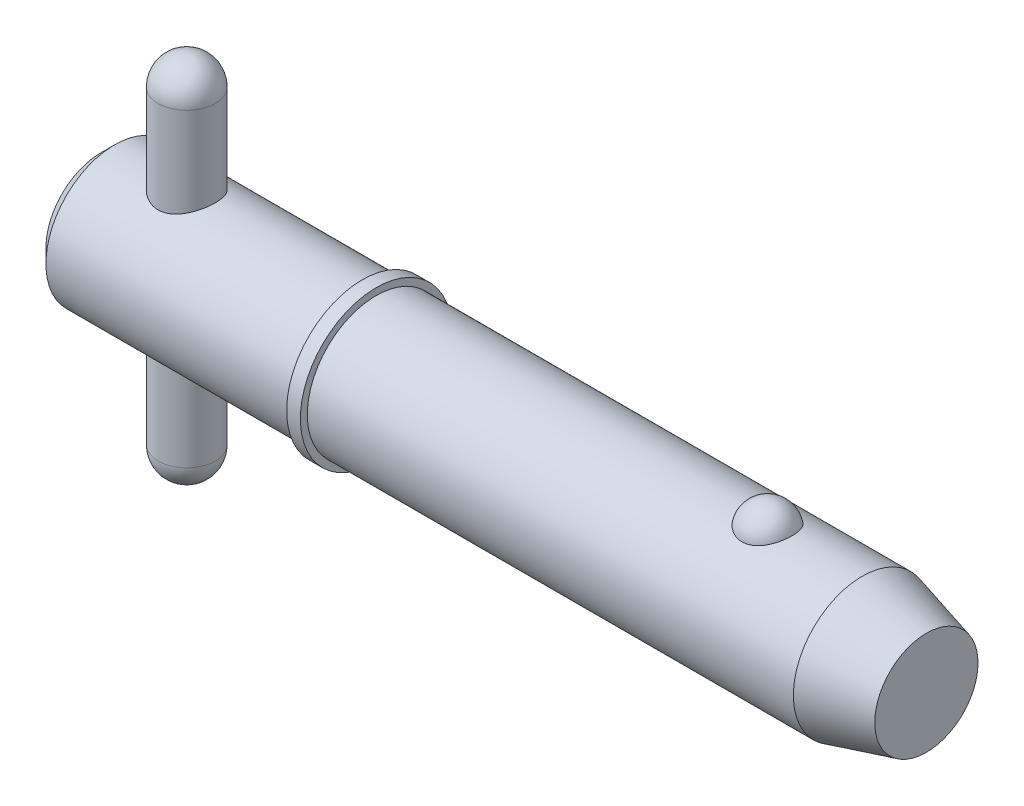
ISO-10303-21;
HEADER;
FILE_DESCRIPTION(('STEP AP214'),'2;1');
FILE_NAME('part.step','',(''),(''),'','','');
FILE_SCHEMA(('AUTOMOTIVE_DESIGN { 1 0 10303 214 1 1 1 1 }'));
ENDSEC;
DATA;
#1=APPLICATION_CONTEXT('core data for automotive mechanical design processes');
#2=APPLICATION_PROTOCOL_DEFINITION('international standard','automotive_design',2000,#1);
#3=PRODUCT_CONTEXT('',#1,'mechanical');
#4=PRODUCT('Part','Part','',(#3));
#5=PRODUCT_RELATED_PRODUCT_CATEGORY('part','',(#4));
#6=PRODUCT_DEFINITION_FORMATION('','',#4);
#7=PRODUCT_DEFINITION_CONTEXT('part definition',#1,'design');
#8=PRODUCT_DEFINITION('design','',#6,#7);
#9=PRODUCT_DEFINITION_SHAPE('','',#8);
#10=(LENGTH_UNIT() NAMED_UNIT(*) SI_UNIT(.MILLI.,.METRE.));
#11=(NAMED_UNIT(*) PLANE_ANGLE_UNIT() SI_UNIT($,.RADIAN.));
#12=(NAMED_UNIT(*) SI_UNIT($,.STERADIAN.) SOLID_ANGLE_UNIT());
#13=UNCERTAINTY_MEASURE_WITH_UNIT(LENGTH_MEASURE(1.E-05),#10,'distance_accuracy_value','');
#14=(GEOMETRIC_REPRESENTATION_CONTEXT(3) GLOBAL_UNCERTAINTY_ASSIGNED_CONTEXT((#13)) GLOBAL_UNIT_ASSIGNED_CONTEXT((#10,
#11,#12)) REPRESENTATION_CONTEXT('',''));
#15=CARTESIAN_POINT('',(0.,0.,0.));
#16=DIRECTION('',(0.,0.,1.));
#17=DIRECTION('',(1.,0.,0.));
#18=AXIS2_PLACEMENT_3D('',#15,#16,#17);
#19=CARTESIAN_POINT('',(5.94,12.7,0.));
#20=DIRECTION('',(0.,-1.,0.));
#21=DIRECTION('',(0.,0.,-1.));
#22=AXIS2_PLACEMENT_3D('',#19,#20,#21);
#23=CYLINDRICAL_SURFACE('',#22,1.98);
#24=CARTESIAN_POINT('',(5.94,-10.72,0.));
#25=DIRECTION('',(0.,-1.,0.));
#26=DIRECTION('',(0.,0.,-1.));
#27=AXIS2_PLACEMENT_3D('',#24,#25,#26);
#28=CIRCLE('',#27,1.98);
#29=CARTESIAN_POINT('',(5.94,-10.72,-1.98));
#30=VERTEX_POINT('',#29);
#31=EDGE_CURVE('P0_E10',#30,#30,#28,.F.);
#32=ORIENTED_EDGE('',*,*,#31,.T.);
#33=EDGE_LOOP('',(#32));
#34=FACE_BOUND('',#33,.T.);
#35=CARTESIAN_POINT('',(5.94,10.72,0.));
#36=DIRECTION('',(0.,-1.,0.));
#37=DIRECTION('',(0.,0.,-1.));
#38=AXIS2_PLACEMENT_3D('',#35,#36,#37);
#39=CIRCLE('',#38,1.98);
#40=CARTESIAN_POINT('',(5.94,10.72,-1.98));
#41=VERTEX_POINT('',#40);
#42=EDGE_CURVE('P0_E21',#41,#41,#39,.T.);
#43=ORIENTED_EDGE('',*,*,#42,.T.);
#44=EDGE_LOOP('',(#43));
#45=FACE_BOUND('',#44,.T.);
#46=ADVANCED_FACE('P0_F14',(#34,#45),#23,.T.);
#47=CARTESIAN_POINT('',(5.94,-10.72,0.));
#48=DIRECTION('',(0.,0.,1.));
#49=DIRECTION('',(1.,0.,0.));
#50=AXIS2_PLACEMENT_3D('',#47,#48,#49);
#51=SPHERICAL_SURFACE('',#50,1.98);
#52=CARTESIAN_POINT('',(5.94,-10.72,0.));
#53=DIRECTION('',(0.,-1.,0.));
#54=DIRECTION('',(0.,0.,-1.));
#55=AXIS2_PLACEMENT_3D('',#52,#53,#54);
#56=SPHERICAL_SURFACE('',#55,1.98);
#57=ORIENTED_EDGE('',*,*,#31,.F.);
#58=EDGE_LOOP('',(#57));
#59=FACE_BOUND('',#58,.T.);
#60=ADVANCED_FACE('P0_F29',(#59),#56,.T.);
#61=CARTESIAN_POINT('',(5.94,10.72,0.));
#62=DIRECTION('',(0.,0.,1.));
#63=DIRECTION('',(1.,0.,0.));
#64=AXIS2_PLACEMENT_3D('',#61,#62,#63);
#65=SPHERICAL_SURFACE('',#64,1.98);
#66=CARTESIAN_POINT('',(5.94,10.72,0.));
#67=DIRECTION('',(0.,-1.,0.));
#68=DIRECTION('',(0.,0.,-1.));
#69=AXIS2_PLACEMENT_3D('',#66,#67,#68);
#70=SPHERICAL_SURFACE('',#69,1.98);
#71=ORIENTED_EDGE('',*,*,#42,.F.);
#72=EDGE_LOOP('',(#71));
#73=FACE_BOUND('',#72,.T.);
#74=ADVANCED_FACE('P0_F16',(#73),#70,.T.);
#75=CLOSED_SHELL('',(#46,#60,#74));
#76=MANIFOLD_SOLID_BREP('P0_B1',#75);
#77=CARTESIAN_POINT('',(0.,0.,0.));
#78=DIRECTION('',(1.,0.,0.));
#79=DIRECTION('',(0.,0.,-1.));
#80=AXIS2_PLACEMENT_3D('',#77,#78,#79);
#81=CYLINDRICAL_SURFACE('',#80,4.765);
#82=CARTESIAN_POINT('',(52.7041944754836,0.,0.));
#83=DIRECTION('',(1.,0.,0.));
#84=DIRECTION('',(0.,0.,-1.));
#85=AXIS2_PLACEMENT_3D('',#82,#83,#84);
#86=CIRCLE('',#85,4.765);
#87=CARTESIAN_POINT('',(52.7041944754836,0.,-4.765));
#88=VERTEX_POINT('',#87);
#89=EDGE_CURVE('P1_E81',#88,#88,#86,.T.);
#90=ORIENTED_EDGE('',*,*,#89,.F.);
#91=EDGE_LOOP('',(#90));
#92=FACE_BOUND('',#91,.T.);
#93=CARTESIAN_POINT('',(19.05,0.,0.));
#94=DIRECTION('',(1.,0.,0.));
#95=DIRECTION('',(0.,0.,-1.));
#96=AXIS2_PLACEMENT_3D('',#93,#94,#95);
#97=CIRCLE('',#96,4.765);
#98=CARTESIAN_POINT('',(19.05,0.,-4.765));
#99=VERTEX_POINT('',#98);
#100=EDGE_CURVE('P1_E85',#99,#99,#97,.T.);
#101=ORIENTED_EDGE('',*,*,#100,.T.);
#102=EDGE_LOOP('',(#101));
#103=FACE_BOUND('',#102,.T.);
#104=CARTESIAN_POINT('',(46.151020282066,4.42764777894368,1.76101111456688));
#105=CARTESIAN_POINT('',(46.0597212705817,4.42764470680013,1.76101422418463));
#106=CARTESIAN_POINT('',(45.9684468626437,4.43059091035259,1.75366340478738));
#107=CARTESIAN_POINT('',(45.7886154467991,4.44201846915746,1.72451180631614));
#108=CARTESIAN_POINT('',(45.7000577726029,4.45049845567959,1.70271460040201));
#109=CARTESIAN_POINT('',(45.5282570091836,4.47200516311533,1.64539370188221));
#110=CARTESIAN_POINT('',(45.4450064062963,4.48502527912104,1.60988994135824));
#111=CARTESIAN_POINT('',(45.2857633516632,4.51419542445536,1.52617873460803));
#112=CARTESIAN_POINT('',(45.2097723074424,4.53034605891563,1.47796883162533));
#113=CARTESIAN_POINT('',(45.0647445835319,4.5645931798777,1.36860494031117));
#114=CARTESIAN_POINT('',(44.9959645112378,4.58273170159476,1.3071242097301));
#115=CARTESIAN_POINT('',(44.8693423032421,4.61870302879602,1.17370204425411));
#116=CARTESIAN_POINT('',(44.8115021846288,4.63653577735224,1.10175868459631));
#117=CARTESIAN_POINT('',(44.7055709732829,4.67090140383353,0.945806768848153));
#118=CARTESIAN_POINT('',(44.6580305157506,4.68734068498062,0.861402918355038));
#119=CARTESIAN_POINT('',(44.5770817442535,4.71628466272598,0.685442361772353));
#120=CARTESIAN_POINT('',(44.5436747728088,4.72878898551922,0.593884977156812));
#121=CARTESIAN_POINT('',(44.491287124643,4.74874061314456,0.404781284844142));
#122=CARTESIAN_POINT('',(44.4725178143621,4.75611366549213,0.307168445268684));
#123=CARTESIAN_POINT('',(44.4505846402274,4.76475393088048,0.109940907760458));
#124=CARTESIAN_POINT('',(44.4474205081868,4.76602124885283,0.0103262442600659));
#125=CARTESIAN_POINT('',(44.4567405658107,4.76232928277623,-0.187629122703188));
#126=CARTESIAN_POINT('',(44.4691588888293,4.7573962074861,-0.285973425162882));
#127=CARTESIAN_POINT('',(44.5092804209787,4.74184975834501,-0.479027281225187));
#128=CARTESIAN_POINT('',(44.5369839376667,4.7312362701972,-0.573736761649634));
#129=CARTESIAN_POINT('',(44.6071581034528,4.70540026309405,-0.756973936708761));
#130=CARTESIAN_POINT('',(44.6496460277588,4.69017235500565,-0.845494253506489));
#131=CARTESIAN_POINT('',(44.748520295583,4.6566986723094,-1.01378033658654));
#132=CARTESIAN_POINT('',(44.8049076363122,4.63845268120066,-1.09354547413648));
#133=CARTESIAN_POINT('',(44.930552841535,4.60085438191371,-1.24228523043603));
#134=CARTESIAN_POINT('',(44.9998439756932,4.58149930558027,-1.31123108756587));
#135=CARTESIAN_POINT('',(45.1496066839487,4.54391653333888,-1.43607409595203));
#136=CARTESIAN_POINT('',(45.2300771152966,4.52568872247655,-1.49197257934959));
#137=CARTESIAN_POINT('',(45.3981500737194,4.49293007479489,-1.58786764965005));
#138=CARTESIAN_POINT('',(45.4855445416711,4.47832346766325,-1.62820219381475));
#139=CARTESIAN_POINT('',(45.666553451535,4.45406011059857,-1.69345757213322));
#140=CARTESIAN_POINT('',(45.7601655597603,4.44440151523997,-1.71838415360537));
#141=CARTESIAN_POINT('',(45.9458939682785,4.43159888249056,-1.75112843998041));
#142=CARTESIAN_POINT('',(46.037849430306,4.42815213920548,-1.75974223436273));
#143=CARTESIAN_POINT('',(46.2219658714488,4.427247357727,-1.76201865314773));
#144=CARTESIAN_POINT('',(46.3141268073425,4.42978816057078,-1.7556841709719));
#145=CARTESIAN_POINT('',(46.4931292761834,4.4403864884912,-1.72869560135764));
#146=CARTESIAN_POINT('',(46.5800474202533,4.44827555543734,-1.70847853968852));
#147=CARTESIAN_POINT('',(46.7491314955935,4.46852246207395,-1.65479562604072));
#148=CARTESIAN_POINT('',(46.8312970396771,4.48088066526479,-1.62132869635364));
#149=CARTESIAN_POINT('',(46.9905916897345,4.50907357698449,-1.54120560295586));
#150=CARTESIAN_POINT('',(47.0675700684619,4.52497884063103,-1.49427526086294));
#151=CARTESIAN_POINT('',(47.2127080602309,4.55845148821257,-1.38881222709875));
#152=CARTESIAN_POINT('',(47.2808656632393,4.57601924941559,-1.33027689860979));
#153=CARTESIAN_POINT('',(47.4100990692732,4.61196537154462,-1.19991049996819));
#154=CARTESIAN_POINT('',(47.4706562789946,4.63034074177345,-1.12756415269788));
#155=CARTESIAN_POINT('',(47.5792797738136,4.66513959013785,-0.973612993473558));
#156=CARTESIAN_POINT('',(47.6273438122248,4.68156271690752,-0.892006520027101));
#157=CARTESIAN_POINT('',(47.711383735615,4.71130224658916,-0.718892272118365));
#158=CARTESIAN_POINT('',(47.7469185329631,4.724501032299,-0.627149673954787));
#159=CARTESIAN_POINT('',(47.8029522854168,4.74571823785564,-0.438611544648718));
#160=CARTESIAN_POINT('',(47.823450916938,4.75373654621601,-0.341815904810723));
#161=CARTESIAN_POINT('',(47.8490338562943,4.76378905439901,-0.145633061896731));
#162=CARTESIAN_POINT('',(47.854076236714,4.76580697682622,-0.0462395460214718));
#163=CARTESIAN_POINT('',(47.8485239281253,4.76360573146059,0.15203857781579));
#164=CARTESIAN_POINT('',(47.8379294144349,4.75938663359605,0.250923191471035));
#165=CARTESIAN_POINT('',(47.8013875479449,4.74516937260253,0.445004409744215));
#166=CARTESIAN_POINT('',(47.7754964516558,4.73519238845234,0.54021317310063));
#167=CARTESIAN_POINT('',(47.7089273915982,4.7104939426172,0.724662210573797));
#168=CARTESIAN_POINT('',(47.668248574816,4.69577220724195,0.813902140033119));
#169=CARTESIAN_POINT('',(47.5727177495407,4.66303767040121,0.984313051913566));
#170=CARTESIAN_POINT('',(47.5178042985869,4.64501070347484,1.06544688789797));
#171=CARTESIAN_POINT('',(47.3950496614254,4.60764678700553,1.21692673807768));
#172=CARTESIAN_POINT('',(47.3272086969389,4.58830985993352,1.2872729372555));
#173=CARTESIAN_POINT('',(47.1805480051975,4.55060370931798,1.41479271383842));
#174=CARTESIAN_POINT('',(47.1017918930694,4.53222967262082,1.47203785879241));
#175=CARTESIAN_POINT('',(46.9349890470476,4.49849576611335,1.57212016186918));
#176=CARTESIAN_POINT('',(46.8469417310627,4.48313608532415,1.61495641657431));
#177=CARTESIAN_POINT('',(46.6597918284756,4.45676184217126,1.68642657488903));
#178=CARTESIAN_POINT('',(46.5603653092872,4.44598302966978,1.71430590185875));
#179=CARTESIAN_POINT('',(46.3576210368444,4.43142918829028,1.7515925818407));
#180=CARTESIAN_POINT('',(46.2543049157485,4.42765125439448,1.76100759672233));
#181=CARTESIAN_POINT('',(46.151020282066,4.42764777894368,1.76101111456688));
#182=B_SPLINE_CURVE_WITH_KNOTS('',3,(#104,#105,#106,#107,#108,#109,#110,#111,#112,#113,#114,
#115,#116,#117,#118,#119,#120,#121,#122,#123,#124,#125,#126,#127,#128,#129,#130,#131,#132,#133,
#134,#135,#136,#137,#138,#139,#140,#141,#142,#143,#144,#145,#146,#147,#148,#149,#150,#151,#152,
#153,#154,#155,#156,#157,#158,#159,#160,#161,#162,#163,#164,#165,#166,#167,#168,#169,#170,#171,
#172,#173,#174,#175,#176,#177,#178,#179,#180,#181),.UNSPECIFIED.,.T.,.F.,(4,2,2,2,2,2,2,2,2,2,2,
2,2,2,2,2,2,2,2,2,2,2,2,2,2,2,2,2,2,2,2,2,2,2,2,2,2,2,4),(0.,0.273517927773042,
0.546968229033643,0.820022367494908,1.09312934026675,1.37393946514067,1.65480131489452,
1.94820420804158,2.24163496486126,2.53922817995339,2.8368162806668,3.13315071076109,
3.42949110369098,3.72617893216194,4.02288805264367,4.32037303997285,4.61782764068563,
4.90840095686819,5.19886582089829,5.4747485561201,5.75057789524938,6.01809977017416,
6.28564340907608,6.55907787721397,6.83257454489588,7.11962987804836,7.40673679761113,
7.70312663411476,7.99952284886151,8.29672237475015,8.59391856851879,8.89002850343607,
9.18615552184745,9.483582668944,9.78100471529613,10.0767610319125,10.3725358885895,
10.6820893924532,10.991514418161),.UNSPECIFIED.);
#183=CARTESIAN_POINT('',(46.151020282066,4.42764777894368,1.76101111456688));
#184=VERTEX_POINT('',#183);
#185=EDGE_CURVE('P1_E35',#184,#184,#182,.T.);
#186=ORIENTED_EDGE('',*,*,#185,.T.);
#187=EDGE_LOOP('',(#186));
#188=FACE_BOUND('',#187,.T.);
#189=ADVANCED_FACE('P1_F13',(#92,#103,#188),#81,.T.);
#190=CARTESIAN_POINT('',(0.,0.,0.));
#191=DIRECTION('',(-1.,0.,0.));
#192=DIRECTION('',(0.,0.,1.));
#193=AXIS2_PLACEMENT_3D('',#190,#191,#192);
#194=PLANE('',#193);
#195=CARTESIAN_POINT('',(0.,0.,0.));
#196=DIRECTION('',(1.,0.,0.));
#197=DIRECTION('',(0.,0.,-1.));
#198=AXIS2_PLACEMENT_3D('',#195,#196,#197);
#199=CIRCLE('',#198,3.812);
#200=CARTESIAN_POINT('',(0.,0.,-3.812));
#201=VERTEX_POINT('',#200);
#202=EDGE_CURVE('P1_E9',#201,#201,#199,.T.);
#203=ORIENTED_EDGE('',*,*,#202,.F.);
#204=EDGE_LOOP('',(#203));
#205=FACE_BOUND('',#204,.T.);
#206=ADVANCED_FACE('P1_F15',(#205),#194,.T.);
#207=CARTESIAN_POINT('',(0.952999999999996,0.,0.));
#208=DIRECTION('',(1.,0.,0.));
#209=DIRECTION('',(0.,0.,-1.));
#210=AXIS2_PLACEMENT_3D('',#207,#208,#209);
#211=CONICAL_SURFACE('',#210,4.765,0.78539816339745);
#212=ORIENTED_EDGE('',*,*,#202,.T.);
#213=EDGE_LOOP('',(#212));
#214=FACE_BOUND('',#213,.T.);
#215=CARTESIAN_POINT('',(0.952999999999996,0.,0.));
#216=DIRECTION('',(1.,0.,0.));
#217=DIRECTION('',(0.,0.,-1.));
#218=AXIS2_PLACEMENT_3D('',#215,#216,#217);
#219=CIRCLE('',#218,4.765);
#220=CARTESIAN_POINT('',(0.952999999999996,0.,-4.765));
#221=VERTEX_POINT('',#220);
#222=EDGE_CURVE('P1_E26',#221,#221,#219,.T.);
#223=ORIENTED_EDGE('',*,*,#222,.F.);
#224=EDGE_LOOP('',(#223));
#225=FACE_BOUND('',#224,.T.);
#226=ADVANCED_FACE('P1_F77',(#214,#225),#211,.T.);
#227=CARTESIAN_POINT('',(0.,0.,0.));
#228=DIRECTION('',(1.,0.,0.));
#229=DIRECTION('',(0.,0.,-1.));
#230=AXIS2_PLACEMENT_3D('',#227,#228,#229);
#231=CYLINDRICAL_SURFACE('',#230,4.765);
#232=CARTESIAN_POINT('',(5.94,-4.33414639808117,1.98));
#233=CARTESIAN_POINT('',(5.83435484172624,-4.33415447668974,1.97999169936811));
#234=CARTESIAN_POINT('',(5.72854887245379,-4.33806396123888,1.97149330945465));
#235=CARTESIAN_POINT('',(5.51998191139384,-4.35319906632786,1.93783487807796));
#236=CARTESIAN_POINT('',(5.41723000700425,-4.3644446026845,1.91262947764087));
#237=CARTESIAN_POINT('',(5.21817294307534,-4.39274225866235,1.84670269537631));
#238=CARTESIAN_POINT('',(5.12184344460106,-4.40977076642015,1.80604432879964));
#239=CARTESIAN_POINT('',(4.93740039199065,-4.44768106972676,1.71055160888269));
#240=CARTESIAN_POINT('',(4.84928487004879,-4.46856193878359,1.65572066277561));
#241=CARTESIAN_POINT('',(4.67826533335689,-4.51326966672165,1.52981120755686));
#242=CARTESIAN_POINT('',(4.59593118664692,-4.53719608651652,1.45799365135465));
#243=CARTESIAN_POINT('',(4.44405452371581,-4.58448035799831,1.30170177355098));
#244=CARTESIAN_POINT('',(4.37451692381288,-4.60783798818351,1.21722260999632));
#245=CARTESIAN_POINT('',(4.24730683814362,-4.65256187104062,1.03353484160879));
#246=CARTESIAN_POINT('',(4.19027484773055,-4.67379892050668,0.933848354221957));
#247=CARTESIAN_POINT('',(4.0940363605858,-4.7106711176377,0.7252544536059));
#248=CARTESIAN_POINT('',(4.05482199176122,-4.72630873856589,0.61635113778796));
#249=CARTESIAN_POINT('',(3.99739515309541,-4.74951416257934,0.398397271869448));
#250=CARTESIAN_POINT('',(3.97820018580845,-4.7574579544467,0.289646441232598));
#251=CARTESIAN_POINT('',(3.95818309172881,-4.76574596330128,0.0701967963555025));
#252=CARTESIAN_POINT('',(3.95735355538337,-4.76609324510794,-0.0405012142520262));
#253=CARTESIAN_POINT('',(3.9735743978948,-4.75937098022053,-0.253561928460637));
#254=CARTESIAN_POINT('',(3.98954548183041,-4.75274912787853,-0.356023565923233));
#255=CARTESIAN_POINT('',(4.03706504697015,-4.73344665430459,-0.556659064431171));
#256=CARTESIAN_POINT('',(4.06861467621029,-4.72076558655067,-0.654832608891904));
#257=CARTESIAN_POINT('',(4.14677192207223,-4.69032846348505,-0.845904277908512));
#258=CARTESIAN_POINT('',(4.19360181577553,-4.67249797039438,-0.938699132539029));
#259=CARTESIAN_POINT('',(4.30077315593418,-4.63350852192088,-1.11535616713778));
#260=CARTESIAN_POINT('',(4.3611193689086,-4.61234839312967,-1.19921518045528));
#261=CARTESIAN_POINT('',(4.49853487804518,-4.56707259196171,-1.3618711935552));
#262=CARTESIAN_POINT('',(4.57648039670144,-4.5428537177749,-1.43990029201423));
#263=CARTESIAN_POINT('',(4.74440779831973,-4.49530722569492,-1.58211009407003));
#264=CARTESIAN_POINT('',(4.83439425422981,-4.47197995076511,-1.64628551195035));
#265=CARTESIAN_POINT('',(5.02755026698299,-4.42812342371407,-1.76092221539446));
#266=CARTESIAN_POINT('',(5.13105348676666,-4.40770990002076,-1.81086937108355));
#267=CARTESIAN_POINT('',(5.34607555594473,-4.37336901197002,-1.89231211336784));
#268=CARTESIAN_POINT('',(5.45758864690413,-4.3594370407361,-1.92382080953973));
#269=CARTESIAN_POINT('',(5.67777275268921,-4.34077746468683,-1.96554536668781));
#270=CARTESIAN_POINT('',(5.78616167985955,-4.33551319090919,-1.9770057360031));
#271=CARTESIAN_POINT('',(6.00341835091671,-4.33325118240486,-1.98196183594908));
#272=CARTESIAN_POINT('',(6.11228591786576,-4.33625061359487,-1.97546372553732));
#273=CARTESIAN_POINT('',(6.32012423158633,-4.34962383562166,-1.94582288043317));
#274=CARTESIAN_POINT('',(6.41928436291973,-4.35951709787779,-1.92376364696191));
#275=CARTESIAN_POINT('',(6.61241543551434,-4.38495043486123,-1.86506038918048));
#276=CARTESIAN_POINT('',(6.70638516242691,-4.40049182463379,-1.82841296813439));
#277=CARTESIAN_POINT('',(6.89090272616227,-4.43627016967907,-1.73985559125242));
#278=CARTESIAN_POINT('',(6.98113841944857,-4.45667771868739,-1.68736639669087));
#279=CARTESIAN_POINT('',(7.1519532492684,-4.49964530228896,-1.56919282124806));
#280=CARTESIAN_POINT('',(7.232528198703,-4.52220626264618,-1.50350275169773));
#281=CARTESIAN_POINT('',(7.38851617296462,-4.56914071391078,-1.35452895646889));
#282=CARTESIAN_POINT('',(7.46298462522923,-4.5935132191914,-1.27025197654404));
#283=CARTESIAN_POINT('',(7.59689029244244,-4.63962841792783,-1.08983181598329));
#284=CARTESIAN_POINT('',(7.65632644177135,-4.66137092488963,-0.993687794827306));
#285=CARTESIAN_POINT('',(7.75840361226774,-4.69991192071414,-0.791608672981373));
#286=CARTESIAN_POINT('',(7.80100481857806,-4.71669866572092,-0.685651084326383));
#287=CARTESIAN_POINT('',(7.86746997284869,-4.74331408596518,-0.467197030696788));
#288=CARTESIAN_POINT('',(7.8913450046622,-4.75314687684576,-0.354704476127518));
#289=CARTESIAN_POINT('',(7.91828971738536,-4.76427543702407,-0.134819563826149));
#290=CARTESIAN_POINT('',(7.92269147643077,-4.76611762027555,-0.027616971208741));
#291=CARTESIAN_POINT('',(7.91414154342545,-4.76256684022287,0.185959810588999));
#292=CARTESIAN_POINT('',(7.90119286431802,-4.75717513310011,0.292334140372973));
#293=CARTESIAN_POINT('',(7.85926572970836,-4.74004856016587,0.497383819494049));
#294=CARTESIAN_POINT('',(7.83086647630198,-4.72854322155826,0.596198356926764));
#295=CARTESIAN_POINT('',(7.75947503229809,-4.70045111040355,0.787624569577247));
#296=CARTESIAN_POINT('',(7.71648006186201,-4.68386336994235,0.880235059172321));
#297=CARTESIAN_POINT('',(7.6149456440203,-4.64628321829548,1.06122875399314));
#298=CARTESIAN_POINT('',(7.55579211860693,-4.62512577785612,1.14923242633));
#299=CARTESIAN_POINT('',(7.42451813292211,-4.58091700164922,1.31443888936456));
#300=CARTESIAN_POINT('',(7.35239289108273,-4.5578649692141,1.39163767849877));
#301=CARTESIAN_POINT('',(7.19146107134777,-4.51050832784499,1.53847013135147));
#302=CARTESIAN_POINT('',(7.10185635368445,-4.48622440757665,1.60723941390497));
#303=CARTESIAN_POINT('',(6.91164948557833,-4.44076541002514,1.72888900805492));
#304=CARTESIAN_POINT('',(6.81104124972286,-4.41959206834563,1.78176046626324));
#305=CARTESIAN_POINT('',(6.60181953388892,-4.38318936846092,1.86953227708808));
#306=CARTESIAN_POINT('',(6.49325511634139,-4.3679267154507,1.90453365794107));
#307=CARTESIAN_POINT('',(6.32681512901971,-4.35102038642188,1.94268459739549));
#308=CARTESIAN_POINT('',(6.27079191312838,-4.34638447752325,1.953006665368));
#309=CARTESIAN_POINT('',(6.15793999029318,-4.33925923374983,1.96879053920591));
#310=CARTESIAN_POINT('',(6.10111188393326,-4.33676837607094,1.97425579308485));
#311=CARTESIAN_POINT('',(6.00947316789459,-4.33456308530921,1.97908711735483));
#312=CARTESIAN_POINT('',(5.97474528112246,-4.33414374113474,1.98000272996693));
#313=CARTESIAN_POINT('',(5.94,-4.33414639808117,1.98));
#314=B_SPLINE_CURVE_WITH_KNOTS('',3,(#232,#233,#234,#235,#236,#237,#238,#239,#240,#241,#242,
#243,#244,#245,#246,#247,#248,#249,#250,#251,#252,#253,#254,#255,#256,#257,#258,#259,#260,#261,
#262,#263,#264,#265,#266,#267,#268,#269,#270,#271,#272,#273,#274,#275,#276,#277,#278,#279,#280,
#281,#282,#283,#284,#285,#286,#287,#288,#289,#290,#291,#292,#293,#294,#295,#296,#297,#298,#299,
#300,#301,#302,#303,#304,#305,#306,#307,#308,#309,#310,#311,#312,#313),.UNSPECIFIED.,.T.,.F.,(4,
2,2,2,2,2,2,2,2,2,2,2,2,2,2,2,2,2,2,2,2,2,2,2,2,2,2,2,2,2,2,2,2,2,2,2,2,2,2,2,4),(0.,
0.316814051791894,0.634491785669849,0.950887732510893,1.2672076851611,1.60127705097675,
1.93547449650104,2.28407463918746,2.63252061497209,2.96292077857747,3.29318763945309,
3.60346227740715,3.91375978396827,4.22878888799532,4.54392926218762,4.88117914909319,
5.21855748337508,5.56691259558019,5.91501972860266,6.24062939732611,6.56612741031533,
6.87094948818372,7.17584258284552,7.49361276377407,7.81152017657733,8.15513975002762,
8.4987836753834,8.8432355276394,9.18748334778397,9.50777781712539,9.8280166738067,
10.1370037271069,10.4460496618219,10.7690461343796,11.0921619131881,11.4371238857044,
11.7822776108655,12.1254577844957,12.2967183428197,12.4678572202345,12.5720531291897),.UNSPECIFIED.);
#315=CARTESIAN_POINT('',(5.94,-4.33414639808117,1.98));
#316=VERTEX_POINT('',#315);
#317=EDGE_CURVE('P1_E17',#316,#316,#314,.T.);
#318=ORIENTED_EDGE('',*,*,#317,.F.);
#319=EDGE_LOOP('',(#318));
#320=FACE_BOUND('',#319,.T.);
#321=CARTESIAN_POINT('',(5.94,4.33414639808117,1.98));
#322=CARTESIAN_POINT('',(6.04564515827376,4.33415447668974,1.97999169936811));
#323=CARTESIAN_POINT('',(6.15145112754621,4.33806396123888,1.97149330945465));
#324=CARTESIAN_POINT('',(6.36001808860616,4.35319906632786,1.93783487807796));
#325=CARTESIAN_POINT('',(6.46276999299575,4.3644446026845,1.91262947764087));
#326=CARTESIAN_POINT('',(6.66182705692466,4.39274225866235,1.84670269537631));
#327=CARTESIAN_POINT('',(6.75815655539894,4.40977076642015,1.80604432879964));
#328=CARTESIAN_POINT('',(6.94259960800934,4.44768106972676,1.71055160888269));
#329=CARTESIAN_POINT('',(7.03071512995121,4.46856193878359,1.65572066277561));
#330=CARTESIAN_POINT('',(7.20173466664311,4.51326966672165,1.52981120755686));
#331=CARTESIAN_POINT('',(7.28406881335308,4.53719608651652,1.45799365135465));
#332=CARTESIAN_POINT('',(7.43594547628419,4.58448035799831,1.30170177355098));
#333=CARTESIAN_POINT('',(7.50548307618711,4.60783798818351,1.21722260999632));
#334=CARTESIAN_POINT('',(7.63269316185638,4.65256187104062,1.03353484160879));
#335=CARTESIAN_POINT('',(7.68972515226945,4.67379892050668,0.933848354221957));
#336=CARTESIAN_POINT('',(7.7859636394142,4.7106711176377,0.7252544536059));
#337=CARTESIAN_POINT('',(7.82517800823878,4.72630873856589,0.61635113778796));
#338=CARTESIAN_POINT('',(7.88260484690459,4.74951416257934,0.398397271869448));
#339=CARTESIAN_POINT('',(7.90179981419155,4.7574579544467,0.289646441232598));
#340=CARTESIAN_POINT('',(7.92181690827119,4.76574596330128,0.0701967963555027));
#341=CARTESIAN_POINT('',(7.92264644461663,4.76609324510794,-0.040501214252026));
#342=CARTESIAN_POINT('',(7.9064256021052,4.75937098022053,-0.253561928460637));
#343=CARTESIAN_POINT('',(7.89045451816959,4.75274912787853,-0.356023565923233));
#344=CARTESIAN_POINT('',(7.84293495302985,4.73344665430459,-0.55665906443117));
#345=CARTESIAN_POINT('',(7.81138532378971,4.72076558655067,-0.654832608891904));
#346=CARTESIAN_POINT('',(7.73322807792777,4.69032846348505,-0.845904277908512));
#347=CARTESIAN_POINT('',(7.68639818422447,4.67249797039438,-0.938699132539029));
#348=CARTESIAN_POINT('',(7.57922684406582,4.63350852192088,-1.11535616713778));
#349=CARTESIAN_POINT('',(7.5188806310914,4.61234839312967,-1.19921518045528));
#350=CARTESIAN_POINT('',(7.38146512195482,4.56707259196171,-1.3618711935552));
#351=CARTESIAN_POINT('',(7.30351960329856,4.5428537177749,-1.43990029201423));
#352=CARTESIAN_POINT('',(7.13559220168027,4.49530722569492,-1.58211009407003));
#353=CARTESIAN_POINT('',(7.04560574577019,4.47197995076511,-1.64628551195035));
#354=CARTESIAN_POINT('',(6.85244973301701,4.42812342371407,-1.76092221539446));
#355=CARTESIAN_POINT('',(6.74894651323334,4.40770990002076,-1.81086937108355));
#356=CARTESIAN_POINT('',(6.53392444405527,4.37336901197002,-1.89231211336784));
#357=CARTESIAN_POINT('',(6.42241135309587,4.3594370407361,-1.92382080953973));
#358=CARTESIAN_POINT('',(6.20222724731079,4.34077746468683,-1.96554536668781));
#359=CARTESIAN_POINT('',(6.09383832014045,4.33551319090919,-1.9770057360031));
#360=CARTESIAN_POINT('',(5.87658164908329,4.33325118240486,-1.98196183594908));
#361=CARTESIAN_POINT('',(5.76771408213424,4.33625061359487,-1.97546372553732));
#362=CARTESIAN_POINT('',(5.55987576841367,4.34962383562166,-1.94582288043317));
#363=CARTESIAN_POINT('',(5.46071563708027,4.35951709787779,-1.92376364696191));
#364=CARTESIAN_POINT('',(5.26758456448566,4.38495043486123,-1.86506038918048));
#365=CARTESIAN_POINT('',(5.17361483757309,4.40049182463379,-1.82841296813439));
#366=CARTESIAN_POINT('',(4.98909727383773,4.43627016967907,-1.73985559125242));
#367=CARTESIAN_POINT('',(4.89886158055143,4.45667771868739,-1.68736639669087));
#368=CARTESIAN_POINT('',(4.72804675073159,4.49964530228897,-1.56919282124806));
#369=CARTESIAN_POINT('',(4.647471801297,4.52220626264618,-1.50350275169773));
#370=CARTESIAN_POINT('',(4.49148382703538,4.56914071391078,-1.35452895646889));
#371=CARTESIAN_POINT('',(4.41701537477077,4.5935132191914,-1.27025197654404));
#372=CARTESIAN_POINT('',(4.28310970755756,4.63962841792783,-1.08983181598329));
#373=CARTESIAN_POINT('',(4.22367355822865,4.66137092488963,-0.993687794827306));
#374=CARTESIAN_POINT('',(4.12159638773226,4.69991192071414,-0.791608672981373));
#375=CARTESIAN_POINT('',(4.07899518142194,4.71669866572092,-0.685651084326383));
#376=CARTESIAN_POINT('',(4.01253002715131,4.74331408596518,-0.467197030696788));
#377=CARTESIAN_POINT('',(3.98865499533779,4.75314687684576,-0.354704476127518));
#378=CARTESIAN_POINT('',(3.96171028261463,4.76427543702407,-0.134819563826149));
#379=CARTESIAN_POINT('',(3.95730852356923,4.76611762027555,-0.0276169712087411));
#380=CARTESIAN_POINT('',(3.96585845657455,4.76256684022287,0.185959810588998));
#381=CARTESIAN_POINT('',(3.97880713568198,4.75717513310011,0.292334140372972));
#382=CARTESIAN_POINT('',(4.02073427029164,4.74004856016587,0.497383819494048));
#383=CARTESIAN_POINT('',(4.04913352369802,4.72854322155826,0.596198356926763));
#384=CARTESIAN_POINT('',(4.12052496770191,4.70045111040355,0.787624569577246));
#385=CARTESIAN_POINT('',(4.16351993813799,4.68386336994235,0.880235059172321));
#386=CARTESIAN_POINT('',(4.2650543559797,4.64628321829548,1.06122875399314));
#387=CARTESIAN_POINT('',(4.32420788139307,4.62512577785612,1.14923242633));
#388=CARTESIAN_POINT('',(4.45548186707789,4.58091700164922,1.31443888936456));
#389=CARTESIAN_POINT('',(4.52760710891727,4.5578649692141,1.39163767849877));
#390=CARTESIAN_POINT('',(4.68853892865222,4.51050832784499,1.53847013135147));
#391=CARTESIAN_POINT('',(4.77814364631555,4.48622440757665,1.60723941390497));
#392=CARTESIAN_POINT('',(4.96835051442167,4.44076541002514,1.72888900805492));
#393=CARTESIAN_POINT('',(5.06895875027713,4.41959206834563,1.78176046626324));
#394=CARTESIAN_POINT('',(5.27818046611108,4.38318936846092,1.86953227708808));
#395=CARTESIAN_POINT('',(5.38674488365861,4.3679267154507,1.90453365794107));
#396=CARTESIAN_POINT('',(5.55318487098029,4.35102038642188,1.94268459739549));
#397=CARTESIAN_POINT('',(5.60920808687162,4.34638447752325,1.953006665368));
#398=CARTESIAN_POINT('',(5.72206000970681,4.33925923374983,1.96879053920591));
#399=CARTESIAN_POINT('',(5.77888811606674,4.33676837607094,1.97425579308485));
#400=CARTESIAN_POINT('',(5.87052683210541,4.33456308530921,1.97908711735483));
#401=CARTESIAN_POINT('',(5.90525471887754,4.33414374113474,1.98000272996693));
#402=CARTESIAN_POINT('',(5.94,4.33414639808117,1.98));
#403=B_SPLINE_CURVE_WITH_KNOTS('',3,(#321,#322,#323,#324,#325,#326,#327,#328,#329,#330,#331,
#332,#333,#334,#335,#336,#337,#338,#339,#340,#341,#342,#343,#344,#345,#346,#347,#348,#349,#350,
#351,#352,#353,#354,#355,#356,#357,#358,#359,#360,#361,#362,#363,#364,#365,#366,#367,#368,#369,
#370,#371,#372,#373,#374,#375,#376,#377,#378,#379,#380,#381,#382,#383,#384,#385,#386,#387,#388,
#389,#390,#391,#392,#393,#394,#395,#396,#397,#398,#399,#400,#401,#402),.UNSPECIFIED.,.T.,.F.,(4,
2,2,2,2,2,2,2,2,2,2,2,2,2,2,2,2,2,2,2,2,2,2,2,2,2,2,2,2,2,2,2,2,2,2,2,2,2,2,2,4),(0.,
0.316814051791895,0.634491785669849,0.950887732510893,1.2672076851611,1.60127705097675,
1.93547449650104,2.28407463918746,2.63252061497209,2.96292077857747,3.29318763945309,
3.60346227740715,3.91375978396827,4.22878888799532,4.54392926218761,4.88117914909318,
5.21855748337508,5.56691259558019,5.91501972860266,6.24062939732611,6.56612741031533,
6.87094948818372,7.17584258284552,7.49361276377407,7.81152017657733,8.15513975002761,
8.4987836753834,8.84323552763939,9.18748334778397,9.50777781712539,9.8280166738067,
10.1370037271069,10.4460496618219,10.7690461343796,11.0921619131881,11.4371238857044,
11.7822776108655,12.1254577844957,12.2967183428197,12.4678572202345,12.5720531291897),.UNSPECIFIED.);
#404=CARTESIAN_POINT('',(5.94,4.33414639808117,1.98));
#405=VERTEX_POINT('',#404);
#406=EDGE_CURVE('P1_E43',#405,#405,#403,.T.);
#407=ORIENTED_EDGE('',*,*,#406,.F.);
#408=EDGE_LOOP('',(#407));
#409=FACE_BOUND('',#408,.T.);
#410=ORIENTED_EDGE('',*,*,#222,.T.);
#411=EDGE_LOOP('',(#410));
#412=FACE_BOUND('',#411,.T.);
#413=CARTESIAN_POINT('',(18.097,0.,0.));
#414=DIRECTION('',(1.,0.,0.));
#415=DIRECTION('',(0.,0.,-1.));
#416=AXIS2_PLACEMENT_3D('',#413,#414,#415);
#417=CIRCLE('',#416,4.765);
#418=CARTESIAN_POINT('',(18.097,0.,-4.765));
#419=VERTEX_POINT('',#418);
#420=EDGE_CURVE('P1_E31',#419,#419,#417,.T.);
#421=ORIENTED_EDGE('',*,*,#420,.F.);
#422=EDGE_LOOP('',(#421));
#423=FACE_BOUND('',#422,.T.);
#424=ADVANCED_FACE('P1_F103',(#320,#409,#412,#423),#231,.T.);
#425=CARTESIAN_POINT('',(18.097,4.765,0.));
#426=DIRECTION('',(-1.,0.,0.));
#427=DIRECTION('',(0.,0.,1.));
#428=AXIS2_PLACEMENT_3D('',#425,#426,#427);
#429=PLANE('',#428);
#430=ORIENTED_EDGE('',*,*,#420,.T.);
#431=EDGE_LOOP('',(#430));
#432=FACE_BOUND('',#431,.T.);
#433=CARTESIAN_POINT('',(18.097,0.,0.));
#434=DIRECTION('',(1.,0.,0.));
#435=DIRECTION('',(0.,0.,-1.));
#436=AXIS2_PLACEMENT_3D('',#433,#434,#435);
#437=CIRCLE('',#436,5.2415);
#438=CARTESIAN_POINT('',(18.097,0.,-5.2415));
#439=VERTEX_POINT('',#438);
#440=EDGE_CURVE('P1_E91',#439,#439,#437,.T.);
#441=ORIENTED_EDGE('',*,*,#440,.F.);
#442=EDGE_LOOP('',(#441));
#443=FACE_BOUND('',#442,.T.);
#444=ADVANCED_FACE('P1_F100',(#432,#443),#429,.T.);
#445=CARTESIAN_POINT('',(0.,0.,0.));
#446=DIRECTION('',(1.,0.,0.));
#447=DIRECTION('',(0.,0.,-1.));
#448=AXIS2_PLACEMENT_3D('',#445,#446,#447);
#449=CYLINDRICAL_SURFACE('',#448,5.2415);
#450=ORIENTED_EDGE('',*,*,#440,.T.);
#451=EDGE_LOOP('',(#450));
#452=FACE_BOUND('',#451,.T.);
#453=CARTESIAN_POINT('',(19.05,0.,0.));
#454=DIRECTION('',(1.,0.,0.));
#455=DIRECTION('',(0.,0.,-1.));
#456=AXIS2_PLACEMENT_3D('',#453,#454,#455);
#457=CIRCLE('',#456,5.2415);
#458=CARTESIAN_POINT('',(19.05,0.,-5.2415));
#459=VERTEX_POINT('',#458);
#460=EDGE_CURVE('P1_E88',#459,#459,#457,.T.);
#461=ORIENTED_EDGE('',*,*,#460,.F.);
#462=EDGE_LOOP('',(#461));
#463=FACE_BOUND('',#462,.T.);
#464=ADVANCED_FACE('P1_F68',(#452,#463),#449,.T.);
#465=CARTESIAN_POINT('',(19.05,5.2415,0.));
#466=DIRECTION('',(1.,0.,0.));
#467=DIRECTION('',(0.,0.,-1.));
#468=AXIS2_PLACEMENT_3D('',#465,#466,#467);
#469=PLANE('',#468);
#470=ORIENTED_EDGE('',*,*,#460,.T.);
#471=EDGE_LOOP('',(#470));
#472=FACE_BOUND('',#471,.T.);
#473=ORIENTED_EDGE('',*,*,#100,.F.);
#474=EDGE_LOOP('',(#473));
#475=FACE_BOUND('',#474,.T.);
#476=ADVANCED_FACE('P1_F62',(#472,#475),#469,.T.);
#477=CARTESIAN_POINT('',(57.15,0.,0.));
#478=DIRECTION('',(-1.,0.,0.));
#479=DIRECTION('',(0.,0.,1.));
#480=AXIS2_PLACEMENT_3D('',#477,#478,#479);
#481=CONICAL_SURFACE('',#480,3.57375000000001,0.26179938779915);
#482=ORIENTED_EDGE('',*,*,#89,.T.);
#483=EDGE_LOOP('',(#482));
#484=FACE_BOUND('',#483,.T.);
#485=CARTESIAN_POINT('',(57.15,0.,0.));
#486=DIRECTION('',(1.,0.,0.));
#487=DIRECTION('',(0.,0.,-1.));
#488=AXIS2_PLACEMENT_3D('',#485,#486,#487);
#489=CIRCLE('',#488,3.57375000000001);
#490=CARTESIAN_POINT('',(57.15,0.,-3.57375000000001));
#491=VERTEX_POINT('',#490);
#492=EDGE_CURVE('P1_E42',#491,#491,#489,.T.);
#493=ORIENTED_EDGE('',*,*,#492,.F.);
#494=EDGE_LOOP('',(#493));
#495=FACE_BOUND('',#494,.T.);
#496=ADVANCED_FACE('P1_F59',(#484,#495),#481,.T.);
#497=CARTESIAN_POINT('',(57.15,3.57375000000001,0.));
#498=DIRECTION('',(1.,0.,0.));
#499=DIRECTION('',(0.,0.,-1.));
#500=AXIS2_PLACEMENT_3D('',#497,#498,#499);
#501=PLANE('',#500);
#502=ORIENTED_EDGE('',*,*,#492,.T.);
#503=EDGE_LOOP('',(#502));
#504=FACE_BOUND('',#503,.T.);
#505=ADVANCED_FACE('P1_F55',(#504),#501,.T.);
#506=CARTESIAN_POINT('',(46.151020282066,4.2885,0.));
#507=DIRECTION('',(-1.,0.,0.));
#508=DIRECTION('',(0.,1.,0.));
#509=AXIS2_PLACEMENT_3D('',#506,#507,#508);
#510=SPHERICAL_SURFACE('',#509,1.7665);
#511=ORIENTED_EDGE('',*,*,#185,.F.);
#512=EDGE_LOOP('',(#511));
#513=FACE_BOUND('',#512,.T.);
#514=ADVANCED_FACE('P1_F50',(#513),#510,.T.);
#515=CARTESIAN_POINT('',(5.94,-5.2415,0.));
#516=DIRECTION('',(0.,1.,0.));
#517=DIRECTION('',(0.,0.,1.));
#518=AXIS2_PLACEMENT_3D('',#515,#516,#517);
#519=CYLINDRICAL_SURFACE('',#518,1.98);
#520=ORIENTED_EDGE('',*,*,#317,.T.);
#521=EDGE_LOOP('',(#520));
#522=FACE_BOUND('',#521,.T.);
#523=ORIENTED_EDGE('',*,*,#406,.T.);
#524=EDGE_LOOP('',(#523));
#525=FACE_BOUND('',#524,.T.);
#526=ADVANCED_FACE('P1_F54',(#522,#525),#519,.F.);
#527=CLOSED_SHELL('',(#189,#206,#226,#424,#444,#464,#476,#496,#505,#514,#526));
#528=MANIFOLD_SOLID_BREP('P1_B1',#527);
#529=ADVANCED_BREP_SHAPE_REPRESENTATION('',(#18,#76,#528),#14);
#530=SHAPE_DEFINITION_REPRESENTATION(#9,#529);
ENDSEC;
END-ISO-10303-21;
